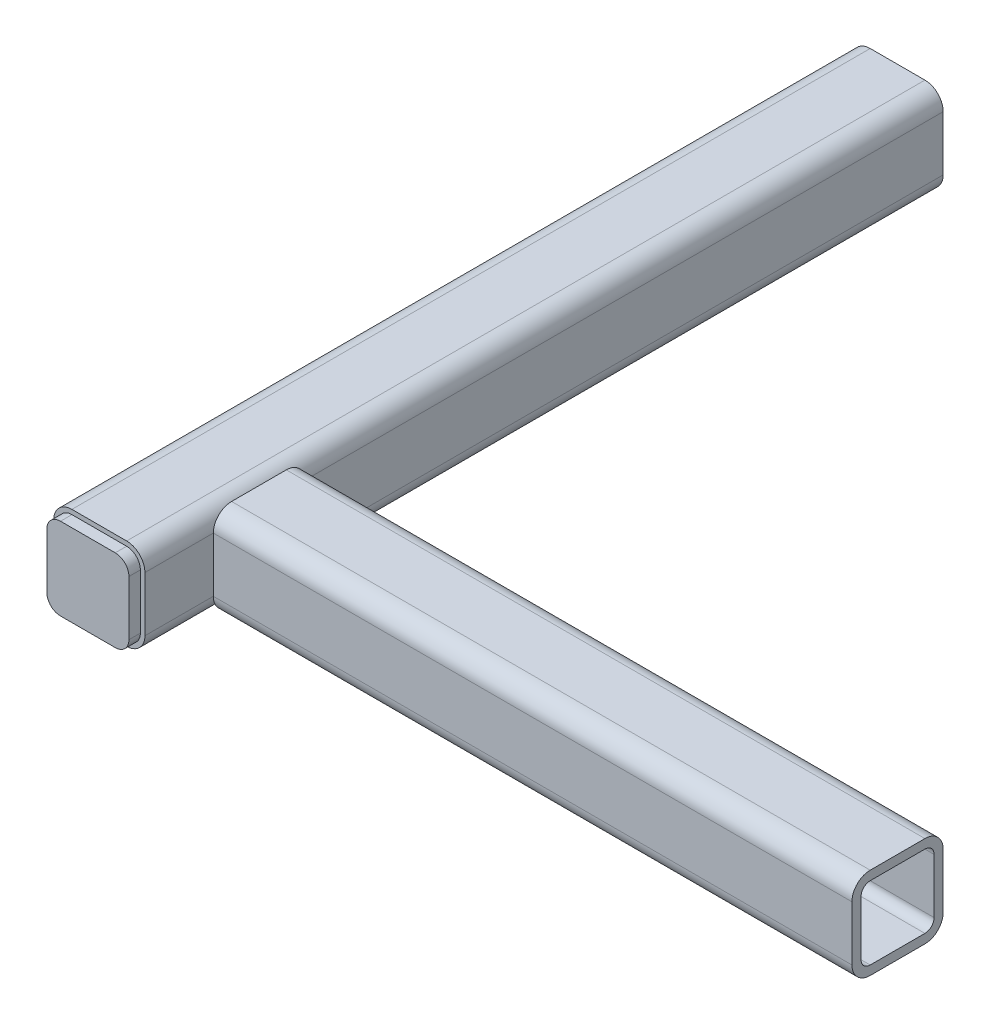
ISO-10303-21;
HEADER;
FILE_DESCRIPTION(('STEP AP214'),'2;1');
FILE_NAME('part.step','',(''),(''),'','','');
FILE_SCHEMA(('AUTOMOTIVE_DESIGN { 1 0 10303 214 1 1 1 1 }'));
ENDSEC;
DATA;
#1=APPLICATION_CONTEXT('core data for automotive mechanical design processes');
#2=APPLICATION_PROTOCOL_DEFINITION('international standard','automotive_design',2000,#1);
#3=PRODUCT_CONTEXT('',#1,'mechanical');
#4=PRODUCT('Part','Part','',(#3));
#5=PRODUCT_RELATED_PRODUCT_CATEGORY('part','',(#4));
#6=PRODUCT_DEFINITION_FORMATION('','',#4);
#7=PRODUCT_DEFINITION_CONTEXT('part definition',#1,'design');
#8=PRODUCT_DEFINITION('design','',#6,#7);
#9=PRODUCT_DEFINITION_SHAPE('','',#8);
#10=(LENGTH_UNIT() NAMED_UNIT(*) SI_UNIT(.MILLI.,.METRE.));
#11=(NAMED_UNIT(*) PLANE_ANGLE_UNIT() SI_UNIT($,.RADIAN.));
#12=(NAMED_UNIT(*) SI_UNIT($,.STERADIAN.) SOLID_ANGLE_UNIT());
#13=UNCERTAINTY_MEASURE_WITH_UNIT(LENGTH_MEASURE(1.E-05),#10,'distance_accuracy_value','');
#14=(GEOMETRIC_REPRESENTATION_CONTEXT(3) GLOBAL_UNCERTAINTY_ASSIGNED_CONTEXT((#13)) GLOBAL_UNIT_ASSIGNED_CONTEXT((#10,
#11,#12)) REPRESENTATION_CONTEXT('',''));
#15=CARTESIAN_POINT('',(0.,0.,0.));
#16=DIRECTION('',(0.,0.,1.));
#17=DIRECTION('',(1.,0.,0.));
#18=AXIS2_PLACEMENT_3D('',#15,#16,#17);
#19=CARTESIAN_POINT('',(-8.99999999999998,9.,27.5));
#20=DIRECTION('',(1.,0.,0.));
#21=DIRECTION('',(0.,0.,-1.));
#22=AXIS2_PLACEMENT_3D('',#19,#20,#21);
#23=PLANE('',#22);
#24=DIRECTION('',(0.,-1.,0.));
#25=VECTOR('',#24,1.);
#26=CARTESIAN_POINT('',(-8.99999999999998,9.,25.));
#27=LINE('',#26,#25);
#28=CARTESIAN_POINT('',(-8.99999999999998,6.,25.));
#29=VERTEX_POINT('',#28);
#30=CARTESIAN_POINT('',(-8.99999999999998,-5.99999999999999,25.));
#31=VERTEX_POINT('',#30);
#32=EDGE_CURVE('E182',#29,#31,#27,.T.);
#33=ORIENTED_EDGE('',*,*,#32,.T.);
#34=DIRECTION('',(0.,0.,-1.));
#35=VECTOR('',#34,1.);
#36=CARTESIAN_POINT('',(-8.99999999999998,-5.99999999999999,27.5));
#37=LINE('',#36,#35);
#38=CARTESIAN_POINT('',(-8.99999999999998,-5.99999999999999,27.5));
#39=VERTEX_POINT('',#38);
#40=EDGE_CURVE('E13',#39,#31,#37,.T.);
#41=ORIENTED_EDGE('',*,*,#40,.F.);
#42=DIRECTION('',(0.,-1.,0.));
#43=VECTOR('',#42,1.);
#44=CARTESIAN_POINT('',(-8.99999999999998,9.,27.5));
#45=LINE('',#44,#43);
#46=CARTESIAN_POINT('',(-8.99999999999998,6.,27.5));
#47=VERTEX_POINT('',#46);
#48=EDGE_CURVE('E196',#47,#39,#45,.T.);
#49=ORIENTED_EDGE('',*,*,#48,.F.);
#50=DIRECTION('',(0.,0.,-1.));
#51=VECTOR('',#50,1.);
#52=CARTESIAN_POINT('',(-8.99999999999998,6.,27.5));
#53=LINE('',#52,#51);
#54=EDGE_CURVE('E178',#47,#29,#53,.T.);
#55=ORIENTED_EDGE('',*,*,#54,.T.);
#56=EDGE_LOOP('',(#33,#41,#49,#55));
#57=FACE_BOUND('',#56,.T.);
#58=ADVANCED_FACE('F86',(#57),#23,.F.);
#59=CARTESIAN_POINT('',(-5.99999999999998,-5.99999999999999,27.5));
#60=DIRECTION('',(0.,0.,-1.));
#61=DIRECTION('',(-1.,0.,0.));
#62=AXIS2_PLACEMENT_3D('',#59,#60,#61);
#63=CYLINDRICAL_SURFACE('',#62,3.);
#64=CARTESIAN_POINT('',(-5.99999999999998,-5.99999999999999,25.));
#65=DIRECTION('',(0.,0.,-1.));
#66=DIRECTION('',(-1.,0.,0.));
#67=AXIS2_PLACEMENT_3D('',#64,#65,#66);
#68=CIRCLE('',#67,3.);
#69=CARTESIAN_POINT('',(-5.99999999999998,-8.99999999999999,25.));
#70=VERTEX_POINT('',#69);
#71=EDGE_CURVE('E185',#31,#70,#68,.F.);
#72=ORIENTED_EDGE('',*,*,#71,.T.);
#73=DIRECTION('',(0.,0.,-1.));
#74=VECTOR('',#73,1.);
#75=CARTESIAN_POINT('',(-5.99999999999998,-8.99999999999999,27.5));
#76=LINE('',#75,#74);
#77=CARTESIAN_POINT('',(-5.99999999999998,-8.99999999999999,27.5));
#78=VERTEX_POINT('',#77);
#79=EDGE_CURVE('E94',#78,#70,#76,.T.);
#80=ORIENTED_EDGE('',*,*,#79,.F.);
#81=CARTESIAN_POINT('',(-5.99999999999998,-5.99999999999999,27.5));
#82=DIRECTION('',(0.,0.,-1.));
#83=DIRECTION('',(-1.,0.,0.));
#84=AXIS2_PLACEMENT_3D('',#81,#82,#83);
#85=CIRCLE('',#84,3.);
#86=EDGE_CURVE('E145',#39,#78,#85,.F.);
#87=ORIENTED_EDGE('',*,*,#86,.F.);
#88=ORIENTED_EDGE('',*,*,#40,.T.);
#89=EDGE_LOOP('',(#72,#80,#87,#88));
#90=FACE_BOUND('',#89,.T.);
#91=ADVANCED_FACE('F231',(#90),#63,.T.);
#92=CARTESIAN_POINT('',(-8.99999999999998,-8.99999999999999,27.5));
#93=DIRECTION('',(0.,1.,0.));
#94=DIRECTION('',(-1.,0.,0.));
#95=AXIS2_PLACEMENT_3D('',#92,#93,#94);
#96=PLANE('',#95);
#97=DIRECTION('',(1.,0.,0.));
#98=VECTOR('',#97,1.);
#99=CARTESIAN_POINT('',(-8.99999999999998,-8.99999999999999,25.));
#100=LINE('',#99,#98);
#101=CARTESIAN_POINT('',(6.00000000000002,-9.,25.));
#102=VERTEX_POINT('',#101);
#103=EDGE_CURVE('E187',#70,#102,#100,.T.);
#104=ORIENTED_EDGE('',*,*,#103,.T.);
#105=DIRECTION('',(0.,0.,-1.));
#106=VECTOR('',#105,1.);
#107=CARTESIAN_POINT('',(6.00000000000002,-9.,27.5));
#108=LINE('',#107,#106);
#109=CARTESIAN_POINT('',(6.00000000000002,-9.,27.5));
#110=VERTEX_POINT('',#109);
#111=EDGE_CURVE('E203',#110,#102,#108,.T.);
#112=ORIENTED_EDGE('',*,*,#111,.F.);
#113=DIRECTION('',(1.,0.,0.));
#114=VECTOR('',#113,1.);
#115=CARTESIAN_POINT('',(-8.99999999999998,-8.99999999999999,27.5));
#116=LINE('',#115,#114);
#117=EDGE_CURVE('E211',#78,#110,#116,.T.);
#118=ORIENTED_EDGE('',*,*,#117,.F.);
#119=ORIENTED_EDGE('',*,*,#79,.T.);
#120=EDGE_LOOP('',(#104,#112,#118,#119));
#121=FACE_BOUND('',#120,.T.);
#122=ADVANCED_FACE('F209',(#121),#96,.F.);
#123=CARTESIAN_POINT('',(6.00000000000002,-6.,27.5));
#124=DIRECTION('',(0.,0.,-1.));
#125=DIRECTION('',(-1.,0.,0.));
#126=AXIS2_PLACEMENT_3D('',#123,#124,#125);
#127=CYLINDRICAL_SURFACE('',#126,3.);
#128=CARTESIAN_POINT('',(6.00000000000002,-6.,25.));
#129=DIRECTION('',(0.,0.,-1.));
#130=DIRECTION('',(-1.,0.,0.));
#131=AXIS2_PLACEMENT_3D('',#128,#129,#130);
#132=CIRCLE('',#131,3.);
#133=CARTESIAN_POINT('',(9.00000000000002,-6.,25.));
#134=VERTEX_POINT('',#133);
#135=EDGE_CURVE('E189',#102,#134,#132,.F.);
#136=ORIENTED_EDGE('',*,*,#135,.T.);
#137=DIRECTION('',(0.,0.,-1.));
#138=VECTOR('',#137,1.);
#139=CARTESIAN_POINT('',(9.00000000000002,-6.,27.5));
#140=LINE('',#139,#138);
#141=CARTESIAN_POINT('',(9.00000000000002,-6.,27.5));
#142=VERTEX_POINT('',#141);
#143=EDGE_CURVE('E200',#142,#134,#140,.T.);
#144=ORIENTED_EDGE('',*,*,#143,.F.);
#145=CARTESIAN_POINT('',(6.00000000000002,-6.,27.5));
#146=DIRECTION('',(0.,0.,-1.));
#147=DIRECTION('',(-1.,0.,0.));
#148=AXIS2_PLACEMENT_3D('',#145,#146,#147);
#149=CIRCLE('',#148,3.);
#150=EDGE_CURVE('E223',#110,#142,#149,.F.);
#151=ORIENTED_EDGE('',*,*,#150,.F.);
#152=ORIENTED_EDGE('',*,*,#111,.T.);
#153=EDGE_LOOP('',(#136,#144,#151,#152));
#154=FACE_BOUND('',#153,.T.);
#155=ADVANCED_FACE('F219',(#154),#127,.T.);
#156=CARTESIAN_POINT('',(9.00000000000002,-9.,27.5));
#157=DIRECTION('',(-1.,0.,0.));
#158=DIRECTION('',(0.,0.,1.));
#159=AXIS2_PLACEMENT_3D('',#156,#157,#158);
#160=PLANE('',#159);
#161=DIRECTION('',(0.,1.,0.));
#162=VECTOR('',#161,1.);
#163=CARTESIAN_POINT('',(9.00000000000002,-9.,25.));
#164=LINE('',#163,#162);
#165=CARTESIAN_POINT('',(9.00000000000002,6.,25.));
#166=VERTEX_POINT('',#165);
#167=EDGE_CURVE('E191',#134,#166,#164,.T.);
#168=ORIENTED_EDGE('',*,*,#167,.T.);
#169=DIRECTION('',(0.,0.,-1.));
#170=VECTOR('',#169,1.);
#171=CARTESIAN_POINT('',(9.00000000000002,6.,27.5));
#172=LINE('',#171,#170);
#173=CARTESIAN_POINT('',(9.00000000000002,6.,27.5));
#174=VERTEX_POINT('',#173);
#175=EDGE_CURVE('E173',#174,#166,#172,.T.);
#176=ORIENTED_EDGE('',*,*,#175,.F.);
#177=DIRECTION('',(0.,1.,0.));
#178=VECTOR('',#177,1.);
#179=CARTESIAN_POINT('',(9.00000000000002,-9.,27.5));
#180=LINE('',#179,#178);
#181=EDGE_CURVE('E164',#142,#174,#180,.T.);
#182=ORIENTED_EDGE('',*,*,#181,.F.);
#183=ORIENTED_EDGE('',*,*,#143,.T.);
#184=EDGE_LOOP('',(#168,#176,#182,#183));
#185=FACE_BOUND('',#184,.T.);
#186=ADVANCED_FACE('F222',(#185),#160,.F.);
#187=CARTESIAN_POINT('',(6.00000000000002,6.,27.5));
#188=DIRECTION('',(0.,0.,-1.));
#189=DIRECTION('',(-1.,0.,0.));
#190=AXIS2_PLACEMENT_3D('',#187,#188,#189);
#191=CYLINDRICAL_SURFACE('',#190,3.);
#192=CARTESIAN_POINT('',(6.00000000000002,6.,25.));
#193=DIRECTION('',(0.,0.,-1.));
#194=DIRECTION('',(-1.,0.,0.));
#195=AXIS2_PLACEMENT_3D('',#192,#193,#194);
#196=CIRCLE('',#195,3.);
#197=CARTESIAN_POINT('',(6.00000000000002,9.,25.));
#198=VERTEX_POINT('',#197);
#199=EDGE_CURVE('E172',#166,#198,#196,.F.);
#200=ORIENTED_EDGE('',*,*,#199,.T.);
#201=DIRECTION('',(0.,0.,-1.));
#202=VECTOR('',#201,1.);
#203=CARTESIAN_POINT('',(6.00000000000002,9.,27.5));
#204=LINE('',#203,#202);
#205=CARTESIAN_POINT('',(6.00000000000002,9.,27.5));
#206=VERTEX_POINT('',#205);
#207=EDGE_CURVE('E169',#206,#198,#204,.T.);
#208=ORIENTED_EDGE('',*,*,#207,.F.);
#209=CARTESIAN_POINT('',(6.00000000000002,6.,27.5));
#210=DIRECTION('',(0.,0.,-1.));
#211=DIRECTION('',(-1.,0.,0.));
#212=AXIS2_PLACEMENT_3D('',#209,#210,#211);
#213=CIRCLE('',#212,3.);
#214=EDGE_CURVE('E158',#174,#206,#213,.F.);
#215=ORIENTED_EDGE('',*,*,#214,.F.);
#216=ORIENTED_EDGE('',*,*,#175,.T.);
#217=EDGE_LOOP('',(#200,#208,#215,#216));
#218=FACE_BOUND('',#217,.T.);
#219=ADVANCED_FACE('F170',(#218),#191,.T.);
#220=CARTESIAN_POINT('',(9.00000000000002,9.,27.5));
#221=DIRECTION('',(0.,-1.,0.));
#222=DIRECTION('',(1.,0.,0.));
#223=AXIS2_PLACEMENT_3D('',#220,#221,#222);
#224=PLANE('',#223);
#225=DIRECTION('',(-1.,0.,0.));
#226=VECTOR('',#225,1.);
#227=CARTESIAN_POINT('',(9.00000000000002,9.,25.));
#228=LINE('',#227,#226);
#229=CARTESIAN_POINT('',(-5.99999999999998,9.,25.));
#230=VERTEX_POINT('',#229);
#231=EDGE_CURVE('E131',#198,#230,#228,.T.);
#232=ORIENTED_EDGE('',*,*,#231,.T.);
#233=DIRECTION('',(0.,0.,-1.));
#234=VECTOR('',#233,1.);
#235=CARTESIAN_POINT('',(-5.99999999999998,9.,27.5));
#236=LINE('',#235,#234);
#237=CARTESIAN_POINT('',(-5.99999999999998,9.,27.5));
#238=VERTEX_POINT('',#237);
#239=EDGE_CURVE('E174',#238,#230,#236,.T.);
#240=ORIENTED_EDGE('',*,*,#239,.F.);
#241=DIRECTION('',(-1.,0.,0.));
#242=VECTOR('',#241,1.);
#243=CARTESIAN_POINT('',(9.00000000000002,9.,27.5));
#244=LINE('',#243,#242);
#245=EDGE_CURVE('E162',#206,#238,#244,.T.);
#246=ORIENTED_EDGE('',*,*,#245,.F.);
#247=ORIENTED_EDGE('',*,*,#207,.T.);
#248=EDGE_LOOP('',(#232,#240,#246,#247));
#249=FACE_BOUND('',#248,.T.);
#250=ADVANCED_FACE('F176',(#249),#224,.F.);
#251=CARTESIAN_POINT('',(-5.99999999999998,6.,27.5));
#252=DIRECTION('',(0.,0.,-1.));
#253=DIRECTION('',(-1.,0.,0.));
#254=AXIS2_PLACEMENT_3D('',#251,#252,#253);
#255=CYLINDRICAL_SURFACE('',#254,3.);
#256=CARTESIAN_POINT('',(-5.99999999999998,6.,25.));
#257=DIRECTION('',(0.,0.,-1.));
#258=DIRECTION('',(-1.,0.,0.));
#259=AXIS2_PLACEMENT_3D('',#256,#257,#258);
#260=CIRCLE('',#259,3.);
#261=EDGE_CURVE('E137',#230,#29,#260,.F.);
#262=ORIENTED_EDGE('',*,*,#261,.T.);
#263=ORIENTED_EDGE('',*,*,#54,.F.);
#264=CARTESIAN_POINT('',(-5.99999999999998,6.,27.5));
#265=DIRECTION('',(0.,0.,-1.));
#266=DIRECTION('',(-1.,0.,0.));
#267=AXIS2_PLACEMENT_3D('',#264,#265,#266);
#268=CIRCLE('',#267,3.);
#269=EDGE_CURVE('E102',#238,#47,#268,.F.);
#270=ORIENTED_EDGE('',*,*,#269,.F.);
#271=ORIENTED_EDGE('',*,*,#239,.T.);
#272=EDGE_LOOP('',(#262,#263,#270,#271));
#273=FACE_BOUND('',#272,.T.);
#274=ADVANCED_FACE('F247',(#273),#255,.T.);
#275=CARTESIAN_POINT('',(-5.99999999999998,-5.99999999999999,27.5));
#276=DIRECTION('',(0.,0.,-1.));
#277=DIRECTION('',(-1.,0.,0.));
#278=AXIS2_PLACEMENT_3D('',#275,#276,#277);
#279=PLANE('',#278);
#280=ORIENTED_EDGE('',*,*,#48,.T.);
#281=ORIENTED_EDGE('',*,*,#86,.T.);
#282=ORIENTED_EDGE('',*,*,#117,.T.);
#283=ORIENTED_EDGE('',*,*,#150,.T.);
#284=ORIENTED_EDGE('',*,*,#181,.T.);
#285=ORIENTED_EDGE('',*,*,#214,.T.);
#286=ORIENTED_EDGE('',*,*,#245,.T.);
#287=ORIENTED_EDGE('',*,*,#269,.T.);
#288=EDGE_LOOP('',(#280,#281,#282,#283,#284,#285,#286,#287));
#289=FACE_BOUND('',#288,.T.);
#290=ADVANCED_FACE('F160',(#289),#279,.F.);
#291=CARTESIAN_POINT('',(-5.99999999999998,-5.99999999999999,25.));
#292=DIRECTION('',(0.,0.,-1.));
#293=DIRECTION('',(-1.,0.,0.));
#294=AXIS2_PLACEMENT_3D('',#291,#292,#293);
#295=PLANE('',#294);
#296=ORIENTED_EDGE('',*,*,#32,.F.);
#297=ORIENTED_EDGE('',*,*,#261,.F.);
#298=ORIENTED_EDGE('',*,*,#231,.F.);
#299=ORIENTED_EDGE('',*,*,#199,.F.);
#300=ORIENTED_EDGE('',*,*,#167,.F.);
#301=ORIENTED_EDGE('',*,*,#135,.F.);
#302=ORIENTED_EDGE('',*,*,#103,.F.);
#303=ORIENTED_EDGE('',*,*,#71,.F.);
#304=EDGE_LOOP('',(#296,#297,#298,#299,#300,#301,#302,#303));
#305=FACE_BOUND('',#304,.T.);
#306=ADVANCED_FACE('F215',(#305),#295,.T.);
#307=CLOSED_SHELL('',(#58,#91,#122,#155,#186,#219,#250,#274,#290,#306));
#308=MANIFOLD_SOLID_BREP('B2',#307);
#309=CARTESIAN_POINT('',(150.,6.,-6.));
#310=DIRECTION('',(-1.,0.,0.));
#311=DIRECTION('',(0.,0.,1.));
#312=AXIS2_PLACEMENT_3D('',#309,#310,#311);
#313=CYLINDRICAL_SURFACE('',#312,4.);
#314=CARTESIAN_POINT('',(10.,6.,-6.));
#315=DIRECTION('',(-1.,0.,0.));
#316=DIRECTION('',(0.,0.,1.));
#317=AXIS2_PLACEMENT_3D('',#314,#315,#316);
#318=CIRCLE('',#317,4.);
#319=CARTESIAN_POINT('',(10.,10.,-6.));
#320=VERTEX_POINT('',#319);
#321=CARTESIAN_POINT('',(10.,6.,-10.));
#322=VERTEX_POINT('',#321);
#323=EDGE_CURVE('E522',#320,#322,#318,.T.);
#324=ORIENTED_EDGE('',*,*,#323,.F.);
#325=DIRECTION('',(-1.,0.,0.));
#326=VECTOR('',#325,1.);
#327=CARTESIAN_POINT('',(150.,10.,-6.));
#328=LINE('',#327,#326);
#329=CARTESIAN_POINT('',(150.,10.,-6.));
#330=VERTEX_POINT('',#329);
#331=EDGE_CURVE('E532',#330,#320,#328,.T.);
#332=ORIENTED_EDGE('',*,*,#331,.F.);
#333=CARTESIAN_POINT('',(150.,6.,-6.));
#334=DIRECTION('',(1.,0.,0.));
#335=DIRECTION('',(0.,0.,-1.));
#336=AXIS2_PLACEMENT_3D('',#333,#334,#335);
#337=CIRCLE('',#336,4.);
#338=CARTESIAN_POINT('',(150.,6.,-10.));
#339=VERTEX_POINT('',#338);
#340=EDGE_CURVE('E552',#339,#330,#337,.T.);
#341=ORIENTED_EDGE('',*,*,#340,.F.);
#342=DIRECTION('',(-1.,0.,0.));
#343=VECTOR('',#342,1.);
#344=CARTESIAN_POINT('',(150.,6.,-10.));
#345=LINE('',#344,#343);
#346=EDGE_CURVE('E536',#339,#322,#345,.T.);
#347=ORIENTED_EDGE('',*,*,#346,.T.);
#348=EDGE_LOOP('',(#324,#332,#341,#347));
#349=FACE_BOUND('',#348,.T.);
#350=ADVANCED_FACE('F343',(#349),#313,.T.);
#351=CARTESIAN_POINT('',(150.,10.,-6.));
#352=DIRECTION('',(0.,-1.,0.));
#353=DIRECTION('',(0.,0.,-1.));
#354=AXIS2_PLACEMENT_3D('',#351,#352,#353);
#355=PLANE('',#354);
#356=DIRECTION('',(0.,0.,-1.));
#357=VECTOR('',#356,1.);
#358=CARTESIAN_POINT('',(10.,10.,25.));
#359=LINE('',#358,#357);
#360=CARTESIAN_POINT('',(10.,10.,6.));
#361=VERTEX_POINT('',#360);
#362=EDGE_CURVE('E402',#361,#320,#359,.T.);
#363=ORIENTED_EDGE('',*,*,#362,.F.);
#364=DIRECTION('',(-1.,0.,0.));
#365=VECTOR('',#364,1.);
#366=CARTESIAN_POINT('',(150.,10.,6.));
#367=LINE('',#366,#365);
#368=CARTESIAN_POINT('',(150.,10.,6.));
#369=VERTEX_POINT('',#368);
#370=EDGE_CURVE('E535',#369,#361,#367,.T.);
#371=ORIENTED_EDGE('',*,*,#370,.F.);
#372=DIRECTION('',(0.,0.,1.));
#373=VECTOR('',#372,1.);
#374=CARTESIAN_POINT('',(150.,10.,-6.));
#375=LINE('',#374,#373);
#376=EDGE_CURVE('E608',#330,#369,#375,.T.);
#377=ORIENTED_EDGE('',*,*,#376,.F.);
#378=ORIENTED_EDGE('',*,*,#331,.T.);
#379=EDGE_LOOP('',(#363,#371,#377,#378));
#380=FACE_BOUND('',#379,.T.);
#381=ADVANCED_FACE('F596',(#380),#355,.F.);
#382=CARTESIAN_POINT('',(150.,6.,6.));
#383=DIRECTION('',(-1.,0.,0.));
#384=DIRECTION('',(0.,0.,1.));
#385=AXIS2_PLACEMENT_3D('',#382,#383,#384);
#386=CYLINDRICAL_SURFACE('',#385,4.);
#387=CARTESIAN_POINT('',(10.,6.,6.));
#388=DIRECTION('',(-1.,0.,0.));
#389=DIRECTION('',(0.,0.,1.));
#390=AXIS2_PLACEMENT_3D('',#387,#388,#389);
#391=CIRCLE('',#390,4.);
#392=CARTESIAN_POINT('',(10.,6.,10.));
#393=VERTEX_POINT('',#392);
#394=EDGE_CURVE('E405',#393,#361,#391,.T.);
#395=ORIENTED_EDGE('',*,*,#394,.F.);
#396=DIRECTION('',(-1.,0.,0.));
#397=VECTOR('',#396,1.);
#398=CARTESIAN_POINT('',(150.,6.,10.));
#399=LINE('',#398,#397);
#400=CARTESIAN_POINT('',(150.,6.,10.));
#401=VERTEX_POINT('',#400);
#402=EDGE_CURVE('E539',#401,#393,#399,.T.);
#403=ORIENTED_EDGE('',*,*,#402,.F.);
#404=CARTESIAN_POINT('',(150.,6.,6.));
#405=DIRECTION('',(1.,0.,0.));
#406=DIRECTION('',(0.,0.,-1.));
#407=AXIS2_PLACEMENT_3D('',#404,#405,#406);
#408=CIRCLE('',#407,4.);
#409=EDGE_CURVE('E611',#369,#401,#408,.T.);
#410=ORIENTED_EDGE('',*,*,#409,.F.);
#411=ORIENTED_EDGE('',*,*,#370,.T.);
#412=EDGE_LOOP('',(#395,#403,#410,#411));
#413=FACE_BOUND('',#412,.T.);
#414=ADVANCED_FACE('F601',(#413),#386,.T.);
#415=CARTESIAN_POINT('',(150.,-6.,10.));
#416=DIRECTION('',(0.,0.,-1.));
#417=DIRECTION('',(-1.,0.,0.));
#418=AXIS2_PLACEMENT_3D('',#415,#416,#417);
#419=PLANE('',#418);
#420=DIRECTION('',(0.,1.,0.));
#421=VECTOR('',#420,1.);
#422=CARTESIAN_POINT('',(10.,-6.,10.));
#423=LINE('',#422,#421);
#424=CARTESIAN_POINT('',(10.,-6.,10.));
#425=VERTEX_POINT('',#424);
#426=EDGE_CURVE('E84',#425,#393,#423,.T.);
#427=ORIENTED_EDGE('',*,*,#426,.F.);
#428=DIRECTION('',(-1.,0.,0.));
#429=VECTOR('',#428,1.);
#430=CARTESIAN_POINT('',(150.,-6.,10.));
#431=LINE('',#430,#429);
#432=CARTESIAN_POINT('',(150.,-6.,10.));
#433=VERTEX_POINT('',#432);
#434=EDGE_CURVE('E530',#433,#425,#431,.T.);
#435=ORIENTED_EDGE('',*,*,#434,.F.);
#436=DIRECTION('',(0.,-1.,0.));
#437=VECTOR('',#436,1.);
#438=CARTESIAN_POINT('',(150.,-6.,10.));
#439=LINE('',#438,#437);
#440=EDGE_CURVE('E616',#401,#433,#439,.T.);
#441=ORIENTED_EDGE('',*,*,#440,.F.);
#442=ORIENTED_EDGE('',*,*,#402,.T.);
#443=EDGE_LOOP('',(#427,#435,#441,#442));
#444=FACE_BOUND('',#443,.T.);
#445=ADVANCED_FACE('F650',(#444),#419,.F.);
#446=CARTESIAN_POINT('',(150.,-6.,6.));
#447=DIRECTION('',(-1.,0.,0.));
#448=DIRECTION('',(0.,0.,1.));
#449=AXIS2_PLACEMENT_3D('',#446,#447,#448);
#450=CYLINDRICAL_SURFACE('',#449,4.);
#451=CARTESIAN_POINT('',(10.,-6.,6.));
#452=DIRECTION('',(-1.,0.,0.));
#453=DIRECTION('',(0.,0.,1.));
#454=AXIS2_PLACEMENT_3D('',#451,#452,#453);
#455=CIRCLE('',#454,4.);
#456=CARTESIAN_POINT('',(10.,-10.,6.));
#457=VERTEX_POINT('',#456);
#458=EDGE_CURVE('E352',#457,#425,#455,.T.);
#459=ORIENTED_EDGE('',*,*,#458,.F.);
#460=DIRECTION('',(-1.,0.,0.));
#461=VECTOR('',#460,1.);
#462=CARTESIAN_POINT('',(150.,-10.,6.));
#463=LINE('',#462,#461);
#464=CARTESIAN_POINT('',(150.,-10.,6.));
#465=VERTEX_POINT('',#464);
#466=EDGE_CURVE('E529',#465,#457,#463,.T.);
#467=ORIENTED_EDGE('',*,*,#466,.F.);
#468=CARTESIAN_POINT('',(150.,-6.,6.));
#469=DIRECTION('',(1.,0.,0.));
#470=DIRECTION('',(0.,0.,-1.));
#471=AXIS2_PLACEMENT_3D('',#468,#469,#470);
#472=CIRCLE('',#471,4.);
#473=EDGE_CURVE('E618',#433,#465,#472,.T.);
#474=ORIENTED_EDGE('',*,*,#473,.F.);
#475=ORIENTED_EDGE('',*,*,#434,.T.);
#476=EDGE_LOOP('',(#459,#467,#474,#475));
#477=FACE_BOUND('',#476,.T.);
#478=ADVANCED_FACE('F646',(#477),#450,.T.);
#479=CARTESIAN_POINT('',(150.,-10.,6.));
#480=DIRECTION('',(0.,1.,0.));
#481=DIRECTION('',(0.,0.,1.));
#482=AXIS2_PLACEMENT_3D('',#479,#480,#481);
#483=PLANE('',#482);
#484=DIRECTION('',(0.,0.,-1.));
#485=VECTOR('',#484,1.);
#486=CARTESIAN_POINT('',(10.,-10.,25.));
#487=LINE('',#486,#485);
#488=CARTESIAN_POINT('',(10.,-10.,-6.));
#489=VERTEX_POINT('',#488);
#490=EDGE_CURVE('E526',#457,#489,#487,.T.);
#491=ORIENTED_EDGE('',*,*,#490,.T.);
#492=DIRECTION('',(-1.,0.,0.));
#493=VECTOR('',#492,1.);
#494=CARTESIAN_POINT('',(150.,-10.,-6.));
#495=LINE('',#494,#493);
#496=CARTESIAN_POINT('',(150.,-10.,-6.));
#497=VERTEX_POINT('',#496);
#498=EDGE_CURVE('E546',#497,#489,#495,.T.);
#499=ORIENTED_EDGE('',*,*,#498,.F.);
#500=DIRECTION('',(0.,0.,-1.));
#501=VECTOR('',#500,1.);
#502=CARTESIAN_POINT('',(150.,-10.,6.));
#503=LINE('',#502,#501);
#504=EDGE_CURVE('E620',#465,#497,#503,.T.);
#505=ORIENTED_EDGE('',*,*,#504,.F.);
#506=ORIENTED_EDGE('',*,*,#466,.T.);
#507=EDGE_LOOP('',(#491,#499,#505,#506));
#508=FACE_BOUND('',#507,.T.);
#509=ADVANCED_FACE('F643',(#508),#483,.F.);
#510=CARTESIAN_POINT('',(150.,-6.,-6.));
#511=DIRECTION('',(-1.,0.,0.));
#512=DIRECTION('',(0.,0.,1.));
#513=AXIS2_PLACEMENT_3D('',#510,#511,#512);
#514=CYLINDRICAL_SURFACE('',#513,4.);
#515=CARTESIAN_POINT('',(10.,-6.,-6.));
#516=DIRECTION('',(-1.,0.,0.));
#517=DIRECTION('',(0.,0.,1.));
#518=AXIS2_PLACEMENT_3D('',#515,#516,#517);
#519=CIRCLE('',#518,4.);
#520=CARTESIAN_POINT('',(10.,-6.,-10.));
#521=VERTEX_POINT('',#520);
#522=EDGE_CURVE('E495',#521,#489,#519,.T.);
#523=ORIENTED_EDGE('',*,*,#522,.F.);
#524=DIRECTION('',(-1.,0.,0.));
#525=VECTOR('',#524,1.);
#526=CARTESIAN_POINT('',(150.,-6.,-10.));
#527=LINE('',#526,#525);
#528=CARTESIAN_POINT('',(150.,-6.,-10.));
#529=VERTEX_POINT('',#528);
#530=EDGE_CURVE('E549',#529,#521,#527,.T.);
#531=ORIENTED_EDGE('',*,*,#530,.F.);
#532=CARTESIAN_POINT('',(150.,-6.,-6.));
#533=DIRECTION('',(1.,0.,0.));
#534=DIRECTION('',(0.,0.,-1.));
#535=AXIS2_PLACEMENT_3D('',#532,#533,#534);
#536=CIRCLE('',#535,4.);
#537=EDGE_CURVE('E622',#497,#529,#536,.T.);
#538=ORIENTED_EDGE('',*,*,#537,.F.);
#539=ORIENTED_EDGE('',*,*,#498,.T.);
#540=EDGE_LOOP('',(#523,#531,#538,#539));
#541=FACE_BOUND('',#540,.T.);
#542=ADVANCED_FACE('F629',(#541),#514,.T.);
#543=CARTESIAN_POINT('',(150.,6.,6.));
#544=DIRECTION('',(-1.,0.,0.));
#545=DIRECTION('',(0.,0.,1.));
#546=AXIS2_PLACEMENT_3D('',#543,#544,#545);
#547=CYLINDRICAL_SURFACE('',#546,2.);
#548=DIRECTION('',(-1.,0.,0.));
#549=VECTOR('',#548,1.);
#550=CARTESIAN_POINT('',(150.,6.,8.));
#551=LINE('',#550,#549);
#552=CARTESIAN_POINT('',(150.,6.,8.));
#553=VERTEX_POINT('',#552);
#554=CARTESIAN_POINT('',(10.,6.,8.));
#555=VERTEX_POINT('',#554);
#556=EDGE_CURVE('E346',#553,#555,#551,.T.);
#557=ORIENTED_EDGE('',*,*,#556,.T.);
#558=CARTESIAN_POINT('',(10.,6.,6.));
#559=DIRECTION('',(-1.,0.,0.));
#560=DIRECTION('',(0.,0.,1.));
#561=AXIS2_PLACEMENT_3D('',#558,#559,#560);
#562=CIRCLE('',#561,2.);
#563=CARTESIAN_POINT('',(10.,8.,6.));
#564=VERTEX_POINT('',#563);
#565=EDGE_CURVE('E410',#555,#564,#562,.T.);
#566=ORIENTED_EDGE('',*,*,#565,.T.);
#567=DIRECTION('',(-1.,0.,0.));
#568=VECTOR('',#567,1.);
#569=CARTESIAN_POINT('',(150.,8.,6.));
#570=LINE('',#569,#568);
#571=CARTESIAN_POINT('',(150.,8.,6.));
#572=VERTEX_POINT('',#571);
#573=EDGE_CURVE('E465',#572,#564,#570,.T.);
#574=ORIENTED_EDGE('',*,*,#573,.F.);
#575=CARTESIAN_POINT('',(150.,6.,6.));
#576=DIRECTION('',(1.,0.,0.));
#577=DIRECTION('',(0.,0.,-1.));
#578=AXIS2_PLACEMENT_3D('',#575,#576,#577);
#579=CIRCLE('',#578,2.);
#580=EDGE_CURVE('E469',#572,#553,#579,.T.);
#581=ORIENTED_EDGE('',*,*,#580,.T.);
#582=EDGE_LOOP('',(#557,#566,#574,#581));
#583=FACE_BOUND('',#582,.T.);
#584=ADVANCED_FACE('F468',(#583),#547,.F.);
#585=CARTESIAN_POINT('',(150.,8.,-6.));
#586=DIRECTION('',(0.,-1.,0.));
#587=DIRECTION('',(0.,0.,-1.));
#588=AXIS2_PLACEMENT_3D('',#585,#586,#587);
#589=PLANE('',#588);
#590=ORIENTED_EDGE('',*,*,#573,.T.);
#591=DIRECTION('',(0.,0.,-1.));
#592=VECTOR('',#591,1.);
#593=CARTESIAN_POINT('',(10.,8.,-5.99999999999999));
#594=LINE('',#593,#592);
#595=CARTESIAN_POINT('',(10.,8.,-6.));
#596=VERTEX_POINT('',#595);
#597=EDGE_CURVE('E471',#564,#596,#594,.T.);
#598=ORIENTED_EDGE('',*,*,#597,.T.);
#599=DIRECTION('',(-1.,0.,0.));
#600=VECTOR('',#599,1.);
#601=CARTESIAN_POINT('',(150.,8.,-6.));
#602=LINE('',#601,#600);
#603=CARTESIAN_POINT('',(150.,8.,-6.));
#604=VERTEX_POINT('',#603);
#605=EDGE_CURVE('E459',#604,#596,#602,.T.);
#606=ORIENTED_EDGE('',*,*,#605,.F.);
#607=DIRECTION('',(0.,0.,1.));
#608=VECTOR('',#607,1.);
#609=CARTESIAN_POINT('',(150.,8.,-6.));
#610=LINE('',#609,#608);
#611=EDGE_CURVE('E477',#604,#572,#610,.T.);
#612=ORIENTED_EDGE('',*,*,#611,.T.);
#613=EDGE_LOOP('',(#590,#598,#606,#612));
#614=FACE_BOUND('',#613,.T.);
#615=ADVANCED_FACE('F483',(#614),#589,.T.);
#616=CARTESIAN_POINT('',(150.,6.,-6.));
#617=DIRECTION('',(-1.,0.,0.));
#618=DIRECTION('',(0.,0.,1.));
#619=AXIS2_PLACEMENT_3D('',#616,#617,#618);
#620=CYLINDRICAL_SURFACE('',#619,2.);
#621=ORIENTED_EDGE('',*,*,#605,.T.);
#622=CARTESIAN_POINT('',(10.,6.,-6.));
#623=DIRECTION('',(-1.,0.,0.));
#624=DIRECTION('',(0.,0.,1.));
#625=AXIS2_PLACEMENT_3D('',#622,#623,#624);
#626=CIRCLE('',#625,2.);
#627=CARTESIAN_POINT('',(10.,6.,-8.));
#628=VERTEX_POINT('',#627);
#629=EDGE_CURVE('E485',#596,#628,#626,.T.);
#630=ORIENTED_EDGE('',*,*,#629,.T.);
#631=DIRECTION('',(-1.,0.,0.));
#632=VECTOR('',#631,1.);
#633=CARTESIAN_POINT('',(150.,6.,-8.));
#634=LINE('',#633,#632);
#635=CARTESIAN_POINT('',(150.,6.,-8.));
#636=VERTEX_POINT('',#635);
#637=EDGE_CURVE('E503',#636,#628,#634,.T.);
#638=ORIENTED_EDGE('',*,*,#637,.F.);
#639=CARTESIAN_POINT('',(150.,6.,-6.));
#640=DIRECTION('',(1.,0.,0.));
#641=DIRECTION('',(0.,0.,-1.));
#642=AXIS2_PLACEMENT_3D('',#639,#640,#641);
#643=CIRCLE('',#642,2.);
#644=EDGE_CURVE('E489',#636,#604,#643,.T.);
#645=ORIENTED_EDGE('',*,*,#644,.T.);
#646=EDGE_LOOP('',(#621,#630,#638,#645));
#647=FACE_BOUND('',#646,.T.);
#648=ADVANCED_FACE('F695',(#647),#620,.F.);
#649=CARTESIAN_POINT('',(150.,6.,-8.));
#650=DIRECTION('',(0.,0.,1.));
#651=DIRECTION('',(1.,0.,0.));
#652=AXIS2_PLACEMENT_3D('',#649,#650,#651);
#653=PLANE('',#652);
#654=ORIENTED_EDGE('',*,*,#637,.T.);
#655=DIRECTION('',(0.,-1.,0.));
#656=VECTOR('',#655,1.);
#657=CARTESIAN_POINT('',(10.,6.,-8.));
#658=LINE('',#657,#656);
#659=CARTESIAN_POINT('',(10.,-6.,-8.));
#660=VERTEX_POINT('',#659);
#661=EDGE_CURVE('E499',#628,#660,#658,.T.);
#662=ORIENTED_EDGE('',*,*,#661,.T.);
#663=DIRECTION('',(-1.,0.,0.));
#664=VECTOR('',#663,1.);
#665=CARTESIAN_POINT('',(150.,-6.,-8.));
#666=LINE('',#665,#664);
#667=CARTESIAN_POINT('',(150.,-6.,-8.));
#668=VERTEX_POINT('',#667);
#669=EDGE_CURVE('E508',#668,#660,#666,.T.);
#670=ORIENTED_EDGE('',*,*,#669,.F.);
#671=DIRECTION('',(0.,1.,0.));
#672=VECTOR('',#671,1.);
#673=CARTESIAN_POINT('',(150.,6.,-8.));
#674=LINE('',#673,#672);
#675=EDGE_CURVE('E502',#668,#636,#674,.T.);
#676=ORIENTED_EDGE('',*,*,#675,.T.);
#677=EDGE_LOOP('',(#654,#662,#670,#676));
#678=FACE_BOUND('',#677,.T.);
#679=ADVANCED_FACE('F576',(#678),#653,.T.);
#680=CARTESIAN_POINT('',(150.,-6.,-6.));
#681=DIRECTION('',(-1.,0.,0.));
#682=DIRECTION('',(0.,0.,1.));
#683=AXIS2_PLACEMENT_3D('',#680,#681,#682);
#684=CYLINDRICAL_SURFACE('',#683,2.);
#685=ORIENTED_EDGE('',*,*,#669,.T.);
#686=CARTESIAN_POINT('',(10.,-6.,-6.));
#687=DIRECTION('',(-1.,0.,0.));
#688=DIRECTION('',(0.,0.,1.));
#689=AXIS2_PLACEMENT_3D('',#686,#687,#688);
#690=CIRCLE('',#689,2.);
#691=CARTESIAN_POINT('',(10.,-8.,-6.));
#692=VERTEX_POINT('',#691);
#693=EDGE_CURVE('E504',#660,#692,#690,.T.);
#694=ORIENTED_EDGE('',*,*,#693,.T.);
#695=DIRECTION('',(-1.,0.,0.));
#696=VECTOR('',#695,1.);
#697=CARTESIAN_POINT('',(150.,-8.,-6.));
#698=LINE('',#697,#696);
#699=CARTESIAN_POINT('',(150.,-8.,-6.));
#700=VERTEX_POINT('',#699);
#701=EDGE_CURVE('E513',#700,#692,#698,.T.);
#702=ORIENTED_EDGE('',*,*,#701,.F.);
#703=CARTESIAN_POINT('',(150.,-6.,-6.));
#704=DIRECTION('',(1.,0.,0.));
#705=DIRECTION('',(0.,0.,-1.));
#706=AXIS2_PLACEMENT_3D('',#703,#704,#705);
#707=CIRCLE('',#706,2.);
#708=EDGE_CURVE('E507',#700,#668,#707,.T.);
#709=ORIENTED_EDGE('',*,*,#708,.T.);
#710=EDGE_LOOP('',(#685,#694,#702,#709));
#711=FACE_BOUND('',#710,.T.);
#712=ADVANCED_FACE('F580',(#711),#684,.F.);
#713=CARTESIAN_POINT('',(150.,-8.,6.));
#714=DIRECTION('',(0.,1.,0.));
#715=DIRECTION('',(0.,0.,1.));
#716=AXIS2_PLACEMENT_3D('',#713,#714,#715);
#717=PLANE('',#716);
#718=ORIENTED_EDGE('',*,*,#701,.T.);
#719=DIRECTION('',(0.,0.,1.));
#720=VECTOR('',#719,1.);
#721=CARTESIAN_POINT('',(10.,-8.,6.00000000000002));
#722=LINE('',#721,#720);
#723=CARTESIAN_POINT('',(10.,-8.,6.));
#724=VERTEX_POINT('',#723);
#725=EDGE_CURVE('E509',#692,#724,#722,.T.);
#726=ORIENTED_EDGE('',*,*,#725,.T.);
#727=DIRECTION('',(-1.,0.,0.));
#728=VECTOR('',#727,1.);
#729=CARTESIAN_POINT('',(150.,-8.,6.));
#730=LINE('',#729,#728);
#731=CARTESIAN_POINT('',(150.,-8.,6.));
#732=VERTEX_POINT('',#731);
#733=EDGE_CURVE('E518',#732,#724,#730,.T.);
#734=ORIENTED_EDGE('',*,*,#733,.F.);
#735=DIRECTION('',(0.,0.,-1.));
#736=VECTOR('',#735,1.);
#737=CARTESIAN_POINT('',(150.,-8.,6.));
#738=LINE('',#737,#736);
#739=EDGE_CURVE('E512',#732,#700,#738,.T.);
#740=ORIENTED_EDGE('',*,*,#739,.T.);
#741=EDGE_LOOP('',(#718,#726,#734,#740));
#742=FACE_BOUND('',#741,.T.);
#743=ADVANCED_FACE('F582',(#742),#717,.T.);
#744=CARTESIAN_POINT('',(150.,-6.,6.));
#745=DIRECTION('',(-1.,0.,0.));
#746=DIRECTION('',(0.,0.,1.));
#747=AXIS2_PLACEMENT_3D('',#744,#745,#746);
#748=CYLINDRICAL_SURFACE('',#747,2.);
#749=ORIENTED_EDGE('',*,*,#733,.T.);
#750=CARTESIAN_POINT('',(10.,-6.,6.));
#751=DIRECTION('',(-1.,0.,0.));
#752=DIRECTION('',(0.,0.,1.));
#753=AXIS2_PLACEMENT_3D('',#750,#751,#752);
#754=CIRCLE('',#753,2.);
#755=CARTESIAN_POINT('',(10.,-6.,8.));
#756=VERTEX_POINT('',#755);
#757=EDGE_CURVE('E514',#724,#756,#754,.T.);
#758=ORIENTED_EDGE('',*,*,#757,.T.);
#759=DIRECTION('',(-1.,0.,0.));
#760=VECTOR('',#759,1.);
#761=CARTESIAN_POINT('',(150.,-6.,8.));
#762=LINE('',#761,#760);
#763=CARTESIAN_POINT('',(150.,-6.,8.));
#764=VERTEX_POINT('',#763);
#765=EDGE_CURVE('E521',#764,#756,#762,.T.);
#766=ORIENTED_EDGE('',*,*,#765,.F.);
#767=CARTESIAN_POINT('',(150.,-6.,6.));
#768=DIRECTION('',(1.,0.,0.));
#769=DIRECTION('',(0.,0.,-1.));
#770=AXIS2_PLACEMENT_3D('',#767,#768,#769);
#771=CIRCLE('',#770,2.);
#772=EDGE_CURVE('E517',#764,#732,#771,.T.);
#773=ORIENTED_EDGE('',*,*,#772,.T.);
#774=EDGE_LOOP('',(#749,#758,#766,#773));
#775=FACE_BOUND('',#774,.T.);
#776=ADVANCED_FACE('F585',(#775),#748,.F.);
#777=CARTESIAN_POINT('',(150.,-6.,8.));
#778=DIRECTION('',(0.,0.,-1.));
#779=DIRECTION('',(-1.,0.,0.));
#780=AXIS2_PLACEMENT_3D('',#777,#778,#779);
#781=PLANE('',#780);
#782=ORIENTED_EDGE('',*,*,#765,.T.);
#783=DIRECTION('',(0.,1.,0.));
#784=VECTOR('',#783,1.);
#785=CARTESIAN_POINT('',(10.,-6.,8.));
#786=LINE('',#785,#784);
#787=EDGE_CURVE('E519',#756,#555,#786,.T.);
#788=ORIENTED_EDGE('',*,*,#787,.T.);
#789=ORIENTED_EDGE('',*,*,#556,.F.);
#790=DIRECTION('',(0.,-1.,0.));
#791=VECTOR('',#790,1.);
#792=CARTESIAN_POINT('',(150.,-6.,8.));
#793=LINE('',#792,#791);
#794=EDGE_CURVE('E481',#553,#764,#793,.T.);
#795=ORIENTED_EDGE('',*,*,#794,.T.);
#796=EDGE_LOOP('',(#782,#788,#789,#795));
#797=FACE_BOUND('',#796,.T.);
#798=ADVANCED_FACE('F583',(#797),#781,.T.);
#799=CARTESIAN_POINT('',(150.,6.,-10.));
#800=DIRECTION('',(0.,0.,1.));
#801=DIRECTION('',(1.,0.,0.));
#802=AXIS2_PLACEMENT_3D('',#799,#800,#801);
#803=PLANE('',#802);
#804=DIRECTION('',(0.,-1.,0.));
#805=VECTOR('',#804,1.);
#806=CARTESIAN_POINT('',(10.,6.,-10.));
#807=LINE('',#806,#805);
#808=EDGE_CURVE('E524',#322,#521,#807,.T.);
#809=ORIENTED_EDGE('',*,*,#808,.F.);
#810=ORIENTED_EDGE('',*,*,#346,.F.);
#811=DIRECTION('',(0.,1.,0.));
#812=VECTOR('',#811,1.);
#813=CARTESIAN_POINT('',(150.,6.,-10.));
#814=LINE('',#813,#812);
#815=EDGE_CURVE('E492',#529,#339,#814,.T.);
#816=ORIENTED_EDGE('',*,*,#815,.F.);
#817=ORIENTED_EDGE('',*,*,#530,.T.);
#818=EDGE_LOOP('',(#809,#810,#816,#817));
#819=FACE_BOUND('',#818,.T.);
#820=ADVANCED_FACE('F592',(#819),#803,.F.);
#821=CARTESIAN_POINT('',(150.,6.,-6.));
#822=DIRECTION('',(1.,0.,0.));
#823=DIRECTION('',(0.,0.,-1.));
#824=AXIS2_PLACEMENT_3D('',#821,#822,#823);
#825=PLANE('',#824);
#826=ORIENTED_EDGE('',*,*,#580,.F.);
#827=ORIENTED_EDGE('',*,*,#611,.F.);
#828=ORIENTED_EDGE('',*,*,#644,.F.);
#829=ORIENTED_EDGE('',*,*,#675,.F.);
#830=ORIENTED_EDGE('',*,*,#708,.F.);
#831=ORIENTED_EDGE('',*,*,#739,.F.);
#832=ORIENTED_EDGE('',*,*,#772,.F.);
#833=ORIENTED_EDGE('',*,*,#794,.F.);
#834=EDGE_LOOP('',(#826,#827,#828,#829,#830,#831,#832,#833));
#835=FACE_BOUND('',#834,.T.);
#836=ORIENTED_EDGE('',*,*,#340,.T.);
#837=ORIENTED_EDGE('',*,*,#376,.T.);
#838=ORIENTED_EDGE('',*,*,#409,.T.);
#839=ORIENTED_EDGE('',*,*,#440,.T.);
#840=ORIENTED_EDGE('',*,*,#473,.T.);
#841=ORIENTED_EDGE('',*,*,#504,.T.);
#842=ORIENTED_EDGE('',*,*,#537,.T.);
#843=ORIENTED_EDGE('',*,*,#815,.T.);
#844=EDGE_LOOP('',(#836,#837,#838,#839,#840,#841,#842,#843));
#845=FACE_BOUND('',#844,.T.);
#846=ADVANCED_FACE('F474',(#835,#845),#825,.T.);
#847=CARTESIAN_POINT('',(10.,6.,25.));
#848=DIRECTION('',(-1.,0.,0.));
#849=DIRECTION('',(0.,0.,1.));
#850=AXIS2_PLACEMENT_3D('',#847,#848,#849);
#851=PLANE('',#850);
#852=ORIENTED_EDGE('',*,*,#787,.F.);
#853=ORIENTED_EDGE('',*,*,#757,.F.);
#854=ORIENTED_EDGE('',*,*,#725,.F.);
#855=ORIENTED_EDGE('',*,*,#693,.F.);
#856=ORIENTED_EDGE('',*,*,#661,.F.);
#857=ORIENTED_EDGE('',*,*,#629,.F.);
#858=ORIENTED_EDGE('',*,*,#597,.F.);
#859=ORIENTED_EDGE('',*,*,#565,.F.);
#860=EDGE_LOOP('',(#852,#853,#854,#855,#856,#857,#858,#859));
#861=FACE_BOUND('',#860,.T.);
#862=ORIENTED_EDGE('',*,*,#394,.T.);
#863=ORIENTED_EDGE('',*,*,#362,.T.);
#864=ORIENTED_EDGE('',*,*,#323,.T.);
#865=ORIENTED_EDGE('',*,*,#808,.T.);
#866=ORIENTED_EDGE('',*,*,#522,.T.);
#867=ORIENTED_EDGE('',*,*,#490,.F.);
#868=ORIENTED_EDGE('',*,*,#458,.T.);
#869=ORIENTED_EDGE('',*,*,#426,.T.);
#870=EDGE_LOOP('',(#862,#863,#864,#865,#866,#867,#868,#869));
#871=FACE_BOUND('',#870,.T.);
#872=ADVANCED_FACE('F584',(#861,#871),#851,.T.);
#873=CLOSED_SHELL('',(#350,#381,#414,#445,#478,#509,#542,#584,#615,#648,#679,#712,#743,#776,
#798,#820,#846,#872));
#874=MANIFOLD_SOLID_BREP('B7',#873);
#875=CARTESIAN_POINT('',(6.00000000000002,6.,25.));
#876=DIRECTION('',(0.,0.,-1.));
#877=DIRECTION('',(-1.,0.,0.));
#878=AXIS2_PLACEMENT_3D('',#875,#876,#877);
#879=CYLINDRICAL_SURFACE('',#878,4.);
#880=CARTESIAN_POINT('',(6.,6.,-150.));
#881=DIRECTION('',(0.,0.,1.));
#882=DIRECTION('',(1.,0.,0.));
#883=AXIS2_PLACEMENT_3D('',#880,#881,#882);
#884=CIRCLE('',#883,4.);
#885=CARTESIAN_POINT('',(10.,6.,-150.));
#886=VERTEX_POINT('',#885);
#887=CARTESIAN_POINT('',(6.,10.,-150.));
#888=VERTEX_POINT('',#887);
#889=EDGE_CURVE('E1055',#886,#888,#884,.T.);
#890=ORIENTED_EDGE('',*,*,#889,.T.);
#891=DIRECTION('',(0.,0.,-1.));
#892=VECTOR('',#891,1.);
#893=CARTESIAN_POINT('',(6.00000000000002,10.,25.));
#894=LINE('',#893,#892);
#895=CARTESIAN_POINT('',(6.00000000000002,10.,25.));
#896=VERTEX_POINT('',#895);
#897=EDGE_CURVE('E341',#896,#888,#894,.T.);
#898=ORIENTED_EDGE('',*,*,#897,.F.);
#899=CARTESIAN_POINT('',(6.00000000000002,6.,25.));
#900=DIRECTION('',(0.,0.,1.));
#901=DIRECTION('',(1.,0.,0.));
#902=AXIS2_PLACEMENT_3D('',#899,#900,#901);
#903=CIRCLE('',#902,4.);
#904=CARTESIAN_POINT('',(10.,6.,25.));
#905=VERTEX_POINT('',#904);
#906=EDGE_CURVE('E1161',#905,#896,#903,.T.);
#907=ORIENTED_EDGE('',*,*,#906,.F.);
#908=DIRECTION('',(0.,0.,-1.));
#909=VECTOR('',#908,1.);
#910=CARTESIAN_POINT('',(10.,6.,25.));
#911=LINE('',#910,#909);
#912=EDGE_CURVE('E1078',#905,#886,#911,.T.);
#913=ORIENTED_EDGE('',*,*,#912,.T.);
#914=EDGE_LOOP('',(#890,#898,#907,#913));
#915=FACE_BOUND('',#914,.T.);
#916=ADVANCED_FACE('F870',(#915),#879,.T.);
#917=CARTESIAN_POINT('',(6.00000000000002,10.,25.));
#918=DIRECTION('',(0.,-1.,0.));
#919=DIRECTION('',(0.,0.,-1.));
#920=AXIS2_PLACEMENT_3D('',#917,#918,#919);
#921=PLANE('',#920);
#922=DIRECTION('',(-1.,0.,0.));
#923=VECTOR('',#922,1.);
#924=CARTESIAN_POINT('',(6.,10.,-150.));
#925=LINE('',#924,#923);
#926=CARTESIAN_POINT('',(-6.,10.,-150.));
#927=VERTEX_POINT('',#926);
#928=EDGE_CURVE('E1059',#888,#927,#925,.T.);
#929=ORIENTED_EDGE('',*,*,#928,.T.);
#930=DIRECTION('',(0.,0.,-1.));
#931=VECTOR('',#930,1.);
#932=CARTESIAN_POINT('',(-5.99999999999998,10.,25.));
#933=LINE('',#932,#931);
#934=CARTESIAN_POINT('',(-5.99999999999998,10.,25.));
#935=VERTEX_POINT('',#934);
#936=EDGE_CURVE('E881',#935,#927,#933,.T.);
#937=ORIENTED_EDGE('',*,*,#936,.F.);
#938=DIRECTION('',(-1.,0.,0.));
#939=VECTOR('',#938,1.);
#940=CARTESIAN_POINT('',(6.00000000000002,10.,25.));
#941=LINE('',#940,#939);
#942=EDGE_CURVE('E1164',#896,#935,#941,.T.);
#943=ORIENTED_EDGE('',*,*,#942,.F.);
#944=ORIENTED_EDGE('',*,*,#897,.T.);
#945=EDGE_LOOP('',(#929,#937,#943,#944));
#946=FACE_BOUND('',#945,.T.);
#947=ADVANCED_FACE('F1203',(#946),#921,.F.);
#948=CARTESIAN_POINT('',(-5.99999999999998,6.,25.));
#949=DIRECTION('',(0.,0.,-1.));
#950=DIRECTION('',(-1.,0.,0.));
#951=AXIS2_PLACEMENT_3D('',#948,#949,#950);
#952=CYLINDRICAL_SURFACE('',#951,4.);
#953=CARTESIAN_POINT('',(-6.,6.,-150.));
#954=DIRECTION('',(0.,0.,1.));
#955=DIRECTION('',(1.,0.,0.));
#956=AXIS2_PLACEMENT_3D('',#953,#954,#955);
#957=CIRCLE('',#956,4.);
#958=CARTESIAN_POINT('',(-10.,6.,-150.));
#959=VERTEX_POINT('',#958);
#960=EDGE_CURVE('E1062',#927,#959,#957,.T.);
#961=ORIENTED_EDGE('',*,*,#960,.T.);
#962=DIRECTION('',(0.,0.,-1.));
#963=VECTOR('',#962,1.);
#964=CARTESIAN_POINT('',(-9.99999999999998,6.,25.));
#965=LINE('',#964,#963);
#966=CARTESIAN_POINT('',(-9.99999999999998,6.,25.));
#967=VERTEX_POINT('',#966);
#968=EDGE_CURVE('E1089',#967,#959,#965,.T.);
#969=ORIENTED_EDGE('',*,*,#968,.F.);
#970=CARTESIAN_POINT('',(-5.99999999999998,6.,25.));
#971=DIRECTION('',(0.,0.,1.));
#972=DIRECTION('',(1.,0.,0.));
#973=AXIS2_PLACEMENT_3D('',#970,#971,#972);
#974=CIRCLE('',#973,4.);
#975=EDGE_CURVE('E1167',#935,#967,#974,.T.);
#976=ORIENTED_EDGE('',*,*,#975,.F.);
#977=ORIENTED_EDGE('',*,*,#936,.T.);
#978=EDGE_LOOP('',(#961,#969,#976,#977));
#979=FACE_BOUND('',#978,.T.);
#980=ADVANCED_FACE('F1208',(#979),#952,.T.);
#981=CARTESIAN_POINT('',(-9.99999999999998,-6.,25.));
#982=DIRECTION('',(1.,0.,0.));
#983=DIRECTION('',(0.,0.,-1.));
#984=AXIS2_PLACEMENT_3D('',#981,#982,#983);
#985=PLANE('',#984);
#986=DIRECTION('',(0.,-1.,0.));
#987=VECTOR('',#986,1.);
#988=CARTESIAN_POINT('',(-10.,-6.,-150.));
#989=LINE('',#988,#987);
#990=CARTESIAN_POINT('',(-10.,-6.,-150.));
#991=VERTEX_POINT('',#990);
#992=EDGE_CURVE('E1065',#959,#991,#989,.T.);
#993=ORIENTED_EDGE('',*,*,#992,.T.);
#994=DIRECTION('',(0.,0.,-1.));
#995=VECTOR('',#994,1.);
#996=CARTESIAN_POINT('',(-9.99999999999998,-6.,25.));
#997=LINE('',#996,#995);
#998=CARTESIAN_POINT('',(-9.99999999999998,-6.,25.));
#999=VERTEX_POINT('',#998);
#1000=EDGE_CURVE('E1085',#999,#991,#997,.T.);
#1001=ORIENTED_EDGE('',*,*,#1000,.F.);
#1002=DIRECTION('',(0.,-1.,0.));
#1003=VECTOR('',#1002,1.);
#1004=CARTESIAN_POINT('',(-9.99999999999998,-6.,25.));
#1005=LINE('',#1004,#1003);
#1006=EDGE_CURVE('E1170',#967,#999,#1005,.T.);
#1007=ORIENTED_EDGE('',*,*,#1006,.F.);
#1008=ORIENTED_EDGE('',*,*,#968,.T.);
#1009=EDGE_LOOP('',(#993,#1001,#1007,#1008));
#1010=FACE_BOUND('',#1009,.T.);
#1011=ADVANCED_FACE('F1178',(#1010),#985,.F.);
#1012=CARTESIAN_POINT('',(-5.99999999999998,-6.,25.));
#1013=DIRECTION('',(0.,0.,-1.));
#1014=DIRECTION('',(-1.,0.,0.));
#1015=AXIS2_PLACEMENT_3D('',#1012,#1013,#1014);
#1016=CYLINDRICAL_SURFACE('',#1015,4.);
#1017=CARTESIAN_POINT('',(-6.,-6.,-150.));
#1018=DIRECTION('',(0.,0.,1.));
#1019=DIRECTION('',(1.,0.,0.));
#1020=AXIS2_PLACEMENT_3D('',#1017,#1018,#1019);
#1021=CIRCLE('',#1020,4.);
#1022=CARTESIAN_POINT('',(-6.,-10.,-150.));
#1023=VERTEX_POINT('',#1022);
#1024=EDGE_CURVE('E1068',#991,#1023,#1021,.T.);
#1025=ORIENTED_EDGE('',*,*,#1024,.T.);
#1026=DIRECTION('',(0.,0.,-1.));
#1027=VECTOR('',#1026,1.);
#1028=CARTESIAN_POINT('',(-5.99999999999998,-10.,25.));
#1029=LINE('',#1028,#1027);
#1030=CARTESIAN_POINT('',(-5.99999999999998,-10.,25.));
#1031=VERTEX_POINT('',#1030);
#1032=EDGE_CURVE('E1012',#1031,#1023,#1029,.T.);
#1033=ORIENTED_EDGE('',*,*,#1032,.F.);
#1034=CARTESIAN_POINT('',(-5.99999999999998,-6.,25.));
#1035=DIRECTION('',(0.,0.,1.));
#1036=DIRECTION('',(1.,0.,0.));
#1037=AXIS2_PLACEMENT_3D('',#1034,#1035,#1036);
#1038=CIRCLE('',#1037,4.);
#1039=EDGE_CURVE('E1001',#999,#1031,#1038,.T.);
#1040=ORIENTED_EDGE('',*,*,#1039,.F.);
#1041=ORIENTED_EDGE('',*,*,#1000,.T.);
#1042=EDGE_LOOP('',(#1025,#1033,#1040,#1041));
#1043=FACE_BOUND('',#1042,.T.);
#1044=ADVANCED_FACE('F1182',(#1043),#1016,.T.);
#1045=CARTESIAN_POINT('',(-5.99999999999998,-10.,25.));
#1046=DIRECTION('',(0.,1.,0.));
#1047=DIRECTION('',(0.,0.,1.));
#1048=AXIS2_PLACEMENT_3D('',#1045,#1046,#1047);
#1049=PLANE('',#1048);
#1050=DIRECTION('',(1.,0.,0.));
#1051=VECTOR('',#1050,1.);
#1052=CARTESIAN_POINT('',(-6.,-10.,-150.));
#1053=LINE('',#1052,#1051);
#1054=CARTESIAN_POINT('',(6.,-10.,-150.));
#1055=VERTEX_POINT('',#1054);
#1056=EDGE_CURVE('E1010',#1023,#1055,#1053,.T.);
#1057=ORIENTED_EDGE('',*,*,#1056,.T.);
#1058=DIRECTION('',(0.,0.,-1.));
#1059=VECTOR('',#1058,1.);
#1060=CARTESIAN_POINT('',(6.00000000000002,-10.,25.));
#1061=LINE('',#1060,#1059);
#1062=CARTESIAN_POINT('',(6.00000000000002,-10.,25.));
#1063=VERTEX_POINT('',#1062);
#1064=EDGE_CURVE('E1007',#1063,#1055,#1061,.T.);
#1065=ORIENTED_EDGE('',*,*,#1064,.F.);
#1066=DIRECTION('',(1.,0.,0.));
#1067=VECTOR('',#1066,1.);
#1068=CARTESIAN_POINT('',(-5.99999999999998,-10.,25.));
#1069=LINE('',#1068,#1067);
#1070=EDGE_CURVE('E995',#1031,#1063,#1069,.T.);
#1071=ORIENTED_EDGE('',*,*,#1070,.F.);
#1072=ORIENTED_EDGE('',*,*,#1032,.T.);
#1073=EDGE_LOOP('',(#1057,#1065,#1071,#1072));
#1074=FACE_BOUND('',#1073,.T.);
#1075=ADVANCED_FACE('F1008',(#1074),#1049,.F.);
#1076=CARTESIAN_POINT('',(6.00000000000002,-6.,25.));
#1077=DIRECTION('',(0.,0.,-1.));
#1078=DIRECTION('',(-1.,0.,0.));
#1079=AXIS2_PLACEMENT_3D('',#1076,#1077,#1078);
#1080=CYLINDRICAL_SURFACE('',#1079,4.);
#1081=CARTESIAN_POINT('',(6.,-6.,-150.));
#1082=DIRECTION('',(0.,0.,1.));
#1083=DIRECTION('',(1.,0.,0.));
#1084=AXIS2_PLACEMENT_3D('',#1081,#1082,#1083);
#1085=CIRCLE('',#1084,4.);
#1086=CARTESIAN_POINT('',(10.,-6.,-150.));
#1087=VERTEX_POINT('',#1086);
#1088=EDGE_CURVE('E943',#1055,#1087,#1085,.T.);
#1089=ORIENTED_EDGE('',*,*,#1088,.T.);
#1090=DIRECTION('',(0.,0.,-1.));
#1091=VECTOR('',#1090,1.);
#1092=CARTESIAN_POINT('',(10.,-6.,25.));
#1093=LINE('',#1092,#1091);
#1094=CARTESIAN_POINT('',(10.,-6.,25.));
#1095=VERTEX_POINT('',#1094);
#1096=EDGE_CURVE('E1013',#1095,#1087,#1093,.T.);
#1097=ORIENTED_EDGE('',*,*,#1096,.F.);
#1098=CARTESIAN_POINT('',(6.00000000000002,-6.,25.));
#1099=DIRECTION('',(0.,0.,1.));
#1100=DIRECTION('',(1.,0.,0.));
#1101=AXIS2_PLACEMENT_3D('',#1098,#1099,#1100);
#1102=CIRCLE('',#1101,4.);
#1103=EDGE_CURVE('E999',#1063,#1095,#1102,.T.);
#1104=ORIENTED_EDGE('',*,*,#1103,.F.);
#1105=ORIENTED_EDGE('',*,*,#1064,.T.);
#1106=EDGE_LOOP('',(#1089,#1097,#1104,#1105));
#1107=FACE_BOUND('',#1106,.T.);
#1108=ADVANCED_FACE('F1015',(#1107),#1080,.T.);
#1109=CARTESIAN_POINT('',(-5.99999999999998,6.,25.));
#1110=DIRECTION('',(0.,0.,-1.));
#1111=DIRECTION('',(-1.,0.,0.));
#1112=AXIS2_PLACEMENT_3D('',#1109,#1110,#1111);
#1113=CYLINDRICAL_SURFACE('',#1112,2.);
#1114=CARTESIAN_POINT('',(-6.,6.,-150.));
#1115=DIRECTION('',(0.,0.,1.));
#1116=DIRECTION('',(1.,0.,0.));
#1117=AXIS2_PLACEMENT_3D('',#1114,#1115,#1116);
#1118=CIRCLE('',#1117,2.);
#1119=CARTESIAN_POINT('',(-6.,8.,-150.));
#1120=VERTEX_POINT('',#1119);
#1121=CARTESIAN_POINT('',(-8.,6.,-150.));
#1122=VERTEX_POINT('',#1121);
#1123=EDGE_CURVE('E1023',#1120,#1122,#1118,.T.);
#1124=ORIENTED_EDGE('',*,*,#1123,.F.);
#1125=DIRECTION('',(0.,0.,-1.));
#1126=VECTOR('',#1125,1.);
#1127=CARTESIAN_POINT('',(-5.99999999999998,8.,25.));
#1128=LINE('',#1127,#1126);
#1129=CARTESIAN_POINT('',(-5.99999999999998,8.,25.));
#1130=VERTEX_POINT('',#1129);
#1131=EDGE_CURVE('E874',#1130,#1120,#1128,.T.);
#1132=ORIENTED_EDGE('',*,*,#1131,.F.);
#1133=CARTESIAN_POINT('',(-5.99999999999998,6.,25.));
#1134=DIRECTION('',(0.,0.,1.));
#1135=DIRECTION('',(1.,0.,0.));
#1136=AXIS2_PLACEMENT_3D('',#1133,#1134,#1135);
#1137=CIRCLE('',#1136,2.);
#1138=CARTESIAN_POINT('',(-7.99999999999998,6.,25.));
#1139=VERTEX_POINT('',#1138);
#1140=EDGE_CURVE('E1077',#1130,#1139,#1137,.T.);
#1141=ORIENTED_EDGE('',*,*,#1140,.T.);
#1142=DIRECTION('',(0.,0.,-1.));
#1143=VECTOR('',#1142,1.);
#1144=CARTESIAN_POINT('',(-7.99999999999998,6.,25.));
#1145=LINE('',#1144,#1143);
#1146=EDGE_CURVE('E1019',#1139,#1122,#1145,.T.);
#1147=ORIENTED_EDGE('',*,*,#1146,.T.);
#1148=EDGE_LOOP('',(#1124,#1132,#1141,#1147));
#1149=FACE_BOUND('',#1148,.T.);
#1150=ADVANCED_FACE('F872',(#1149),#1113,.F.);
#1151=CARTESIAN_POINT('',(6.00000000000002,8.,25.));
#1152=DIRECTION('',(0.,-1.,0.));
#1153=DIRECTION('',(0.,0.,-1.));
#1154=AXIS2_PLACEMENT_3D('',#1151,#1152,#1153);
#1155=PLANE('',#1154);
#1156=DIRECTION('',(-1.,0.,0.));
#1157=VECTOR('',#1156,1.);
#1158=CARTESIAN_POINT('',(6.,8.,-150.));
#1159=LINE('',#1158,#1157);
#1160=CARTESIAN_POINT('',(6.,8.,-150.));
#1161=VERTEX_POINT('',#1160);
#1162=EDGE_CURVE('E1027',#1161,#1120,#1159,.T.);
#1163=ORIENTED_EDGE('',*,*,#1162,.F.);
#1164=DIRECTION('',(0.,0.,-1.));
#1165=VECTOR('',#1164,1.);
#1166=CARTESIAN_POINT('',(6.00000000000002,8.,25.));
#1167=LINE('',#1166,#1165);
#1168=CARTESIAN_POINT('',(6.00000000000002,8.,25.));
#1169=VERTEX_POINT('',#1168);
#1170=EDGE_CURVE('E1112',#1169,#1161,#1167,.T.);
#1171=ORIENTED_EDGE('',*,*,#1170,.F.);
#1172=DIRECTION('',(-1.,0.,0.));
#1173=VECTOR('',#1172,1.);
#1174=CARTESIAN_POINT('',(6.00000000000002,8.,25.));
#1175=LINE('',#1174,#1173);
#1176=EDGE_CURVE('E1123',#1169,#1130,#1175,.T.);
#1177=ORIENTED_EDGE('',*,*,#1176,.T.);
#1178=ORIENTED_EDGE('',*,*,#1131,.T.);
#1179=EDGE_LOOP('',(#1163,#1171,#1177,#1178));
#1180=FACE_BOUND('',#1179,.T.);
#1181=ADVANCED_FACE('F1121',(#1180),#1155,.T.);
#1182=CARTESIAN_POINT('',(6.00000000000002,6.,25.));
#1183=DIRECTION('',(0.,0.,-1.));
#1184=DIRECTION('',(-1.,0.,0.));
#1185=AXIS2_PLACEMENT_3D('',#1182,#1183,#1184);
#1186=CYLINDRICAL_SURFACE('',#1185,2.);
#1187=CARTESIAN_POINT('',(6.,6.,-150.));
#1188=DIRECTION('',(0.,0.,1.));
#1189=DIRECTION('',(1.,0.,0.));
#1190=AXIS2_PLACEMENT_3D('',#1187,#1188,#1189);
#1191=CIRCLE('',#1190,2.);
#1192=CARTESIAN_POINT('',(8.,6.,-150.));
#1193=VERTEX_POINT('',#1192);
#1194=EDGE_CURVE('E1031',#1193,#1161,#1191,.T.);
#1195=ORIENTED_EDGE('',*,*,#1194,.F.);
#1196=DIRECTION('',(0.,0.,-1.));
#1197=VECTOR('',#1196,1.);
#1198=CARTESIAN_POINT('',(8.00000000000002,6.,25.));
#1199=LINE('',#1198,#1197);
#1200=CARTESIAN_POINT('',(8.00000000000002,6.,25.));
#1201=VERTEX_POINT('',#1200);
#1202=EDGE_CURVE('E1110',#1201,#1193,#1199,.T.);
#1203=ORIENTED_EDGE('',*,*,#1202,.F.);
#1204=CARTESIAN_POINT('',(6.00000000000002,6.,25.));
#1205=DIRECTION('',(0.,0.,1.));
#1206=DIRECTION('',(1.,0.,0.));
#1207=AXIS2_PLACEMENT_3D('',#1204,#1205,#1206);
#1208=CIRCLE('',#1207,2.);
#1209=EDGE_CURVE('E1131',#1201,#1169,#1208,.T.);
#1210=ORIENTED_EDGE('',*,*,#1209,.T.);
#1211=ORIENTED_EDGE('',*,*,#1170,.T.);
#1212=EDGE_LOOP('',(#1195,#1203,#1210,#1211));
#1213=FACE_BOUND('',#1212,.T.);
#1214=ADVANCED_FACE('F1129',(#1213),#1186,.F.);
#1215=CARTESIAN_POINT('',(8.00000000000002,6.,25.));
#1216=DIRECTION('',(-1.,0.,0.));
#1217=DIRECTION('',(0.,0.,1.));
#1218=AXIS2_PLACEMENT_3D('',#1215,#1216,#1217);
#1219=PLANE('',#1218);
#1220=DIRECTION('',(0.,1.,0.));
#1221=VECTOR('',#1220,1.);
#1222=CARTESIAN_POINT('',(8.,6.,-150.));
#1223=LINE('',#1222,#1221);
#1224=CARTESIAN_POINT('',(8.,-6.,-150.));
#1225=VERTEX_POINT('',#1224);
#1226=EDGE_CURVE('E1035',#1225,#1193,#1223,.T.);
#1227=ORIENTED_EDGE('',*,*,#1226,.F.);
#1228=DIRECTION('',(0.,0.,-1.));
#1229=VECTOR('',#1228,1.);
#1230=CARTESIAN_POINT('',(8.00000000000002,-6.,25.));
#1231=LINE('',#1230,#1229);
#1232=CARTESIAN_POINT('',(8.00000000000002,-6.,25.));
#1233=VERTEX_POINT('',#1232);
#1234=EDGE_CURVE('E1107',#1233,#1225,#1231,.T.);
#1235=ORIENTED_EDGE('',*,*,#1234,.F.);
#1236=DIRECTION('',(0.,1.,0.));
#1237=VECTOR('',#1236,1.);
#1238=CARTESIAN_POINT('',(8.00000000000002,6.,25.));
#1239=LINE('',#1238,#1237);
#1240=EDGE_CURVE('E1137',#1233,#1201,#1239,.T.);
#1241=ORIENTED_EDGE('',*,*,#1240,.T.);
#1242=ORIENTED_EDGE('',*,*,#1202,.T.);
#1243=EDGE_LOOP('',(#1227,#1235,#1241,#1242));
#1244=FACE_BOUND('',#1243,.T.);
#1245=ADVANCED_FACE('F1141',(#1244),#1219,.T.);
#1246=CARTESIAN_POINT('',(6.00000000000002,-6.,25.));
#1247=DIRECTION('',(0.,0.,-1.));
#1248=DIRECTION('',(-1.,0.,0.));
#1249=AXIS2_PLACEMENT_3D('',#1246,#1247,#1248);
#1250=CYLINDRICAL_SURFACE('',#1249,2.);
#1251=CARTESIAN_POINT('',(6.,-6.,-150.));
#1252=DIRECTION('',(0.,0.,1.));
#1253=DIRECTION('',(1.,0.,0.));
#1254=AXIS2_PLACEMENT_3D('',#1251,#1252,#1253);
#1255=CIRCLE('',#1254,2.);
#1256=CARTESIAN_POINT('',(6.,-8.,-150.));
#1257=VERTEX_POINT('',#1256);
#1258=EDGE_CURVE('E1039',#1257,#1225,#1255,.T.);
#1259=ORIENTED_EDGE('',*,*,#1258,.F.);
#1260=DIRECTION('',(0.,0.,-1.));
#1261=VECTOR('',#1260,1.);
#1262=CARTESIAN_POINT('',(6.00000000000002,-8.,25.));
#1263=LINE('',#1262,#1261);
#1264=CARTESIAN_POINT('',(6.00000000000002,-8.,25.));
#1265=VERTEX_POINT('',#1264);
#1266=EDGE_CURVE('E1104',#1265,#1257,#1263,.T.);
#1267=ORIENTED_EDGE('',*,*,#1266,.F.);
#1268=CARTESIAN_POINT('',(6.00000000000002,-6.,25.));
#1269=DIRECTION('',(0.,0.,1.));
#1270=DIRECTION('',(1.,0.,0.));
#1271=AXIS2_PLACEMENT_3D('',#1268,#1269,#1270);
#1272=CIRCLE('',#1271,2.);
#1273=EDGE_CURVE('E1143',#1265,#1233,#1272,.T.);
#1274=ORIENTED_EDGE('',*,*,#1273,.T.);
#1275=ORIENTED_EDGE('',*,*,#1234,.T.);
#1276=EDGE_LOOP('',(#1259,#1267,#1274,#1275));
#1277=FACE_BOUND('',#1276,.T.);
#1278=ADVANCED_FACE('F1219',(#1277),#1250,.F.);
#1279=CARTESIAN_POINT('',(-5.99999999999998,-8.,25.));
#1280=DIRECTION('',(0.,1.,0.));
#1281=DIRECTION('',(0.,0.,1.));
#1282=AXIS2_PLACEMENT_3D('',#1279,#1280,#1281);
#1283=PLANE('',#1282);
#1284=DIRECTION('',(1.,0.,0.));
#1285=VECTOR('',#1284,1.);
#1286=CARTESIAN_POINT('',(-6.,-8.,-150.));
#1287=LINE('',#1286,#1285);
#1288=CARTESIAN_POINT('',(-6.,-8.,-150.));
#1289=VERTEX_POINT('',#1288);
#1290=EDGE_CURVE('E1043',#1289,#1257,#1287,.T.);
#1291=ORIENTED_EDGE('',*,*,#1290,.F.);
#1292=DIRECTION('',(0.,0.,-1.));
#1293=VECTOR('',#1292,1.);
#1294=CARTESIAN_POINT('',(-5.99999999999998,-8.,25.));
#1295=LINE('',#1294,#1293);
#1296=CARTESIAN_POINT('',(-5.99999999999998,-8.,25.));
#1297=VERTEX_POINT('',#1296);
#1298=EDGE_CURVE('E1101',#1297,#1289,#1295,.T.);
#1299=ORIENTED_EDGE('',*,*,#1298,.F.);
#1300=DIRECTION('',(1.,0.,0.));
#1301=VECTOR('',#1300,1.);
#1302=CARTESIAN_POINT('',(-5.99999999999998,-8.,25.));
#1303=LINE('',#1302,#1301);
#1304=EDGE_CURVE('E1146',#1297,#1265,#1303,.T.);
#1305=ORIENTED_EDGE('',*,*,#1304,.T.);
#1306=ORIENTED_EDGE('',*,*,#1266,.T.);
#1307=EDGE_LOOP('',(#1291,#1299,#1305,#1306));
#1308=FACE_BOUND('',#1307,.T.);
#1309=ADVANCED_FACE('F1215',(#1308),#1283,.T.);
#1310=CARTESIAN_POINT('',(-5.99999999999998,-6.,25.));
#1311=DIRECTION('',(0.,0.,-1.));
#1312=DIRECTION('',(-1.,0.,0.));
#1313=AXIS2_PLACEMENT_3D('',#1310,#1311,#1312);
#1314=CYLINDRICAL_SURFACE('',#1313,2.);
#1315=CARTESIAN_POINT('',(-6.,-6.,-150.));
#1316=DIRECTION('',(0.,0.,1.));
#1317=DIRECTION('',(1.,0.,0.));
#1318=AXIS2_PLACEMENT_3D('',#1315,#1316,#1317);
#1319=CIRCLE('',#1318,2.);
#1320=CARTESIAN_POINT('',(-8.,-6.,-150.));
#1321=VERTEX_POINT('',#1320);
#1322=EDGE_CURVE('E1047',#1321,#1289,#1319,.T.);
#1323=ORIENTED_EDGE('',*,*,#1322,.F.);
#1324=DIRECTION('',(0.,0.,-1.));
#1325=VECTOR('',#1324,1.);
#1326=CARTESIAN_POINT('',(-7.99999999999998,-6.,25.));
#1327=LINE('',#1326,#1325);
#1328=CARTESIAN_POINT('',(-7.99999999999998,-6.,25.));
#1329=VERTEX_POINT('',#1328);
#1330=EDGE_CURVE('E1098',#1329,#1321,#1327,.T.);
#1331=ORIENTED_EDGE('',*,*,#1330,.F.);
#1332=CARTESIAN_POINT('',(-5.99999999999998,-6.,25.));
#1333=DIRECTION('',(0.,0.,1.));
#1334=DIRECTION('',(1.,0.,0.));
#1335=AXIS2_PLACEMENT_3D('',#1332,#1333,#1334);
#1336=CIRCLE('',#1335,2.);
#1337=EDGE_CURVE('E1153',#1329,#1297,#1336,.T.);
#1338=ORIENTED_EDGE('',*,*,#1337,.T.);
#1339=ORIENTED_EDGE('',*,*,#1298,.T.);
#1340=EDGE_LOOP('',(#1323,#1331,#1338,#1339));
#1341=FACE_BOUND('',#1340,.T.);
#1342=ADVANCED_FACE('F1197',(#1341),#1314,.F.);
#1343=CARTESIAN_POINT('',(-7.99999999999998,-6.,25.));
#1344=DIRECTION('',(1.,0.,0.));
#1345=DIRECTION('',(0.,0.,-1.));
#1346=AXIS2_PLACEMENT_3D('',#1343,#1344,#1345);
#1347=PLANE('',#1346);
#1348=DIRECTION('',(0.,-1.,0.));
#1349=VECTOR('',#1348,1.);
#1350=CARTESIAN_POINT('',(-8.,-6.,-150.));
#1351=LINE('',#1350,#1349);
#1352=EDGE_CURVE('E1051',#1122,#1321,#1351,.T.);
#1353=ORIENTED_EDGE('',*,*,#1352,.F.);
#1354=ORIENTED_EDGE('',*,*,#1146,.F.);
#1355=DIRECTION('',(0.,-1.,0.));
#1356=VECTOR('',#1355,1.);
#1357=CARTESIAN_POINT('',(-7.99999999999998,-6.,25.));
#1358=LINE('',#1357,#1356);
#1359=EDGE_CURVE('E1157',#1139,#1329,#1358,.T.);
#1360=ORIENTED_EDGE('',*,*,#1359,.T.);
#1361=ORIENTED_EDGE('',*,*,#1330,.T.);
#1362=EDGE_LOOP('',(#1353,#1354,#1360,#1361));
#1363=FACE_BOUND('',#1362,.T.);
#1364=ADVANCED_FACE('F1190',(#1363),#1347,.T.);
#1365=CARTESIAN_POINT('',(10.,6.,25.));
#1366=DIRECTION('',(-1.,0.,0.));
#1367=DIRECTION('',(0.,0.,1.));
#1368=AXIS2_PLACEMENT_3D('',#1365,#1366,#1367);
#1369=PLANE('',#1368);
#1370=DIRECTION('',(0.,1.,0.));
#1371=VECTOR('',#1370,1.);
#1372=CARTESIAN_POINT('',(10.,6.,-150.));
#1373=LINE('',#1372,#1371);
#1374=EDGE_CURVE('E949',#1087,#886,#1373,.T.);
#1375=ORIENTED_EDGE('',*,*,#1374,.T.);
#1376=ORIENTED_EDGE('',*,*,#912,.F.);
#1377=DIRECTION('',(0.,1.,0.));
#1378=VECTOR('',#1377,1.);
#1379=CARTESIAN_POINT('',(10.,6.,25.));
#1380=LINE('',#1379,#1378);
#1381=EDGE_CURVE('E890',#1095,#905,#1380,.T.);
#1382=ORIENTED_EDGE('',*,*,#1381,.F.);
#1383=ORIENTED_EDGE('',*,*,#1096,.T.);
#1384=EDGE_LOOP('',(#1375,#1376,#1382,#1383));
#1385=FACE_BOUND('',#1384,.T.);
#1386=ADVANCED_FACE('F1188',(#1385),#1369,.F.);
#1387=CARTESIAN_POINT('',(6.00000000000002,6.,25.));
#1388=DIRECTION('',(0.,0.,1.));
#1389=DIRECTION('',(1.,0.,0.));
#1390=AXIS2_PLACEMENT_3D('',#1387,#1388,#1389);
#1391=PLANE('',#1390);
#1392=ORIENTED_EDGE('',*,*,#1140,.F.);
#1393=ORIENTED_EDGE('',*,*,#1176,.F.);
#1394=ORIENTED_EDGE('',*,*,#1209,.F.);
#1395=ORIENTED_EDGE('',*,*,#1240,.F.);
#1396=ORIENTED_EDGE('',*,*,#1273,.F.);
#1397=ORIENTED_EDGE('',*,*,#1304,.F.);
#1398=ORIENTED_EDGE('',*,*,#1337,.F.);
#1399=ORIENTED_EDGE('',*,*,#1359,.F.);
#1400=EDGE_LOOP('',(#1392,#1393,#1394,#1395,#1396,#1397,#1398,#1399));
#1401=FACE_BOUND('',#1400,.T.);
#1402=ORIENTED_EDGE('',*,*,#906,.T.);
#1403=ORIENTED_EDGE('',*,*,#942,.T.);
#1404=ORIENTED_EDGE('',*,*,#975,.T.);
#1405=ORIENTED_EDGE('',*,*,#1006,.T.);
#1406=ORIENTED_EDGE('',*,*,#1039,.T.);
#1407=ORIENTED_EDGE('',*,*,#1070,.T.);
#1408=ORIENTED_EDGE('',*,*,#1103,.T.);
#1409=ORIENTED_EDGE('',*,*,#1381,.T.);
#1410=EDGE_LOOP('',(#1402,#1403,#1404,#1405,#1406,#1407,#1408,#1409));
#1411=FACE_BOUND('',#1410,.T.);
#1412=ADVANCED_FACE('F997',(#1401,#1411),#1391,.T.);
#1413=CARTESIAN_POINT('',(6.,6.,-150.));
#1414=DIRECTION('',(0.,0.,1.));
#1415=DIRECTION('',(1.,0.,0.));
#1416=AXIS2_PLACEMENT_3D('',#1413,#1414,#1415);
#1417=PLANE('',#1416);
#1418=ORIENTED_EDGE('',*,*,#1123,.T.);
#1419=ORIENTED_EDGE('',*,*,#1352,.T.);
#1420=ORIENTED_EDGE('',*,*,#1322,.T.);
#1421=ORIENTED_EDGE('',*,*,#1290,.T.);
#1422=ORIENTED_EDGE('',*,*,#1258,.T.);
#1423=ORIENTED_EDGE('',*,*,#1226,.T.);
#1424=ORIENTED_EDGE('',*,*,#1194,.T.);
#1425=ORIENTED_EDGE('',*,*,#1162,.T.);
#1426=EDGE_LOOP('',(#1418,#1419,#1420,#1421,#1422,#1423,#1424,#1425));
#1427=FACE_BOUND('',#1426,.T.);
#1428=ORIENTED_EDGE('',*,*,#889,.F.);
#1429=ORIENTED_EDGE('',*,*,#1374,.F.);
#1430=ORIENTED_EDGE('',*,*,#1088,.F.);
#1431=ORIENTED_EDGE('',*,*,#1056,.F.);
#1432=ORIENTED_EDGE('',*,*,#1024,.F.);
#1433=ORIENTED_EDGE('',*,*,#992,.F.);
#1434=ORIENTED_EDGE('',*,*,#960,.F.);
#1435=ORIENTED_EDGE('',*,*,#928,.F.);
#1436=EDGE_LOOP('',(#1428,#1429,#1430,#1431,#1432,#1433,#1434,#1435));
#1437=FACE_BOUND('',#1436,.T.);
#1438=ADVANCED_FACE('F1126',(#1427,#1437),#1417,.F.);
#1439=CLOSED_SHELL('',(#916,#947,#980,#1011,#1044,#1075,#1108,#1150,#1181,#1214,#1245,#1278,
#1309,#1342,#1364,#1386,#1412,#1438));
#1440=MANIFOLD_SOLID_BREP('B78',#1439);
#1441=ADVANCED_BREP_SHAPE_REPRESENTATION('',(#18,#308,#874,#1440),#14);
#1442=SHAPE_DEFINITION_REPRESENTATION(#9,#1441);
ENDSEC;
END-ISO-10303-21;
